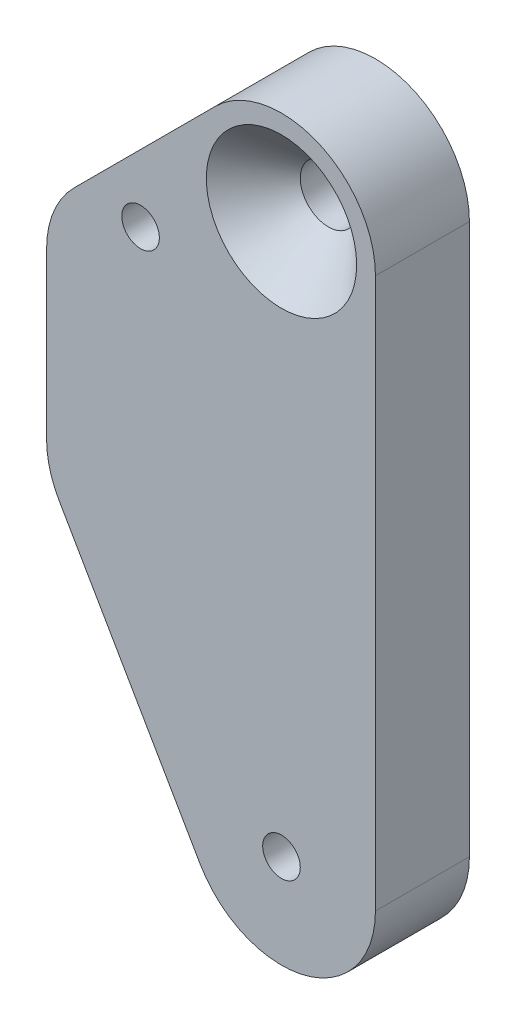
ISO-10303-21;
HEADER;
FILE_DESCRIPTION(('STEP AP214'),'2;1');
FILE_NAME('part.step','',(''),(''),'','','');
FILE_SCHEMA(('AUTOMOTIVE_DESIGN { 1 0 10303 214 1 1 1 1 }'));
ENDSEC;
DATA;
#1=APPLICATION_CONTEXT('core data for automotive mechanical design processes');
#2=APPLICATION_PROTOCOL_DEFINITION('international standard','automotive_design',2000,#1);
#3=PRODUCT_CONTEXT('',#1,'mechanical');
#4=PRODUCT('Part','Part','',(#3));
#5=PRODUCT_RELATED_PRODUCT_CATEGORY('part','',(#4));
#6=PRODUCT_DEFINITION_FORMATION('','',#4);
#7=PRODUCT_DEFINITION_CONTEXT('part definition',#1,'design');
#8=PRODUCT_DEFINITION('design','',#6,#7);
#9=PRODUCT_DEFINITION_SHAPE('','',#8);
#10=(LENGTH_UNIT() NAMED_UNIT(*) SI_UNIT(.MILLI.,.METRE.));
#11=(NAMED_UNIT(*) PLANE_ANGLE_UNIT() SI_UNIT($,.RADIAN.));
#12=(NAMED_UNIT(*) SI_UNIT($,.STERADIAN.) SOLID_ANGLE_UNIT());
#13=UNCERTAINTY_MEASURE_WITH_UNIT(LENGTH_MEASURE(1.E-05),#10,'distance_accuracy_value','');
#14=(GEOMETRIC_REPRESENTATION_CONTEXT(3) GLOBAL_UNCERTAINTY_ASSIGNED_CONTEXT((#13)) GLOBAL_UNIT_ASSIGNED_CONTEXT((#10,
#11,#12)) REPRESENTATION_CONTEXT('',''));
#15=CARTESIAN_POINT('',(0.,0.,0.));
#16=DIRECTION('',(0.,0.,1.));
#17=DIRECTION('',(1.,0.,0.));
#18=AXIS2_PLACEMENT_3D('',#15,#16,#17);
#19=CARTESIAN_POINT('',(-25.,115.,10.));
#20=DIRECTION('',(0.,0.,1.));
#21=DIRECTION('',(1.,0.,0.));
#22=AXIS2_PLACEMENT_3D('',#19,#20,#21);
#23=PLANE('',#22);
#24=CARTESIAN_POINT('',(-25.,115.,10.));
#25=DIRECTION('',(0.,0.,1.));
#26=DIRECTION('',(1.,0.,0.));
#27=AXIS2_PLACEMENT_3D('',#24,#25,#26);
#28=CIRCLE('',#27,8.00000000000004);
#29=CARTESIAN_POINT('',(-17.,115.,10.));
#30=VERTEX_POINT('',#29);
#31=EDGE_CURVE('E11',#30,#30,#28,.F.);
#32=ORIENTED_EDGE('',*,*,#31,.T.);
#33=EDGE_LOOP('',(#32));
#34=FACE_BOUND('',#33,.T.);
#35=CARTESIAN_POINT('',(-40.,107.,10.));
#36=DIRECTION('',(0.,0.,1.));
#37=DIRECTION('',(1.,0.,0.));
#38=AXIS2_PLACEMENT_3D('',#35,#36,#37);
#39=CIRCLE('',#38,2.);
#40=CARTESIAN_POINT('',(-38.,107.,10.));
#41=VERTEX_POINT('',#40);
#42=EDGE_CURVE('E248',#41,#41,#39,.T.);
#43=ORIENTED_EDGE('',*,*,#42,.F.);
#44=EDGE_LOOP('',(#43));
#45=FACE_BOUND('',#44,.T.);
#46=CARTESIAN_POINT('',(-25.,115.,10.));
#47=DIRECTION('',(0.,0.,1.));
#48=DIRECTION('',(1.,0.,0.));
#49=AXIS2_PLACEMENT_3D('',#46,#47,#48);
#50=CIRCLE('',#49,10.);
#51=CARTESIAN_POINT('',(-15.,115.,10.));
#52=VERTEX_POINT('',#51);
#53=CARTESIAN_POINT('',(-32.0710678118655,122.071067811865,10.));
#54=VERTEX_POINT('',#53);
#55=EDGE_CURVE('E156',#52,#54,#50,.T.);
#56=ORIENTED_EDGE('',*,*,#55,.T.);
#57=DIRECTION('',(-0.707106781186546,-0.707106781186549,0.));
#58=VECTOR('',#57,1.);
#59=CARTESIAN_POINT('',(-47.0710678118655,107.071067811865,10.));
#60=LINE('',#59,#58);
#61=CARTESIAN_POINT('',(-47.0710678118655,107.071067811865,10.));
#62=VERTEX_POINT('',#61);
#63=EDGE_CURVE('E98',#54,#62,#60,.T.);
#64=ORIENTED_EDGE('',*,*,#63,.T.);
#65=CARTESIAN_POINT('',(-40.,99.9999999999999,10.));
#66=DIRECTION('',(0.,0.,1.));
#67=DIRECTION('',(1.,0.,0.));
#68=AXIS2_PLACEMENT_3D('',#65,#66,#67);
#69=CIRCLE('',#68,10.);
#70=CARTESIAN_POINT('',(-50.,99.9999999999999,10.));
#71=VERTEX_POINT('',#70);
#72=EDGE_CURVE('E238',#62,#71,#69,.T.);
#73=ORIENTED_EDGE('',*,*,#72,.T.);
#74=DIRECTION('',(0.,-1.,0.));
#75=VECTOR('',#74,1.);
#76=CARTESIAN_POINT('',(-50.,99.9999999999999,10.));
#77=LINE('',#76,#75);
#78=CARTESIAN_POINT('',(-50.,82.4372013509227,10.));
#79=VERTEX_POINT('',#78);
#80=EDGE_CURVE('E240',#71,#79,#77,.T.);
#81=ORIENTED_EDGE('',*,*,#80,.T.);
#82=CARTESIAN_POINT('',(-40.,82.4372013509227,10.));
#83=DIRECTION('',(0.,0.,1.));
#84=DIRECTION('',(1.,0.,0.));
#85=AXIS2_PLACEMENT_3D('',#82,#83,#84);
#86=CIRCLE('',#85,10.);
#87=CARTESIAN_POINT('',(-48.6602540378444,77.4372013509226,10.));
#88=VERTEX_POINT('',#87);
#89=EDGE_CURVE('E119',#79,#88,#86,.T.);
#90=ORIENTED_EDGE('',*,*,#89,.T.);
#91=DIRECTION('',(0.500000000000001,-0.866025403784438,0.));
#92=VECTOR('',#91,1.);
#93=CARTESIAN_POINT('',(-48.6602540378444,77.4372013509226,10.));
#94=LINE('',#93,#92);
#95=CARTESIAN_POINT('',(-33.6602540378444,51.4564392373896,10.));
#96=VERTEX_POINT('',#95);
#97=EDGE_CURVE('E112',#88,#96,#94,.T.);
#98=ORIENTED_EDGE('',*,*,#97,.T.);
#99=CARTESIAN_POINT('',(-25.,56.4564392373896,10.));
#100=DIRECTION('',(0.,0.,1.));
#101=DIRECTION('',(1.,0.,0.));
#102=AXIS2_PLACEMENT_3D('',#99,#100,#101);
#103=CIRCLE('',#102,10.);
#104=CARTESIAN_POINT('',(-15.,56.4564392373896,10.));
#105=VERTEX_POINT('',#104);
#106=EDGE_CURVE('E116',#96,#105,#103,.T.);
#107=ORIENTED_EDGE('',*,*,#106,.T.);
#108=DIRECTION('',(0.,1.,0.));
#109=VECTOR('',#108,1.);
#110=CARTESIAN_POINT('',(-15.,115.,10.));
#111=LINE('',#110,#109);
#112=EDGE_CURVE('E56',#105,#52,#111,.T.);
#113=ORIENTED_EDGE('',*,*,#112,.T.);
#114=EDGE_LOOP('',(#56,#64,#73,#81,#90,#98,#107,#113));
#115=FACE_BOUND('',#114,.T.);
#116=CARTESIAN_POINT('',(-25.,56.4564392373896,10.));
#117=DIRECTION('',(0.,0.,1.));
#118=DIRECTION('',(1.,0.,0.));
#119=AXIS2_PLACEMENT_3D('',#116,#117,#118);
#120=CIRCLE('',#119,2.);
#121=CARTESIAN_POINT('',(-23.,56.4564392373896,10.));
#122=VERTEX_POINT('',#121);
#123=EDGE_CURVE('E252',#122,#122,#120,.T.);
#124=ORIENTED_EDGE('',*,*,#123,.F.);
#125=EDGE_LOOP('',(#124));
#126=FACE_BOUND('',#125,.T.);
#127=ADVANCED_FACE('F33',(#34,#45,#115,#126),#23,.T.);
#128=CARTESIAN_POINT('',(-25.,115.,0.));
#129=DIRECTION('',(0.,0.,1.));
#130=DIRECTION('',(1.,0.,0.));
#131=AXIS2_PLACEMENT_3D('',#128,#129,#130);
#132=PLANE('',#131);
#133=CARTESIAN_POINT('',(-40.,107.,0.));
#134=DIRECTION('',(0.,0.,1.));
#135=DIRECTION('',(1.,0.,0.));
#136=AXIS2_PLACEMENT_3D('',#133,#134,#135);
#137=CIRCLE('',#136,2.);
#138=CARTESIAN_POINT('',(-38.,107.,0.));
#139=VERTEX_POINT('',#138);
#140=EDGE_CURVE('E249',#139,#139,#137,.T.);
#141=ORIENTED_EDGE('',*,*,#140,.T.);
#142=EDGE_LOOP('',(#141));
#143=FACE_BOUND('',#142,.T.);
#144=CARTESIAN_POINT('',(-25.,115.,0.));
#145=DIRECTION('',(0.,0.,1.));
#146=DIRECTION('',(1.,0.,0.));
#147=AXIS2_PLACEMENT_3D('',#144,#145,#146);
#148=CIRCLE('',#147,10.);
#149=CARTESIAN_POINT('',(-15.,115.,0.));
#150=VERTEX_POINT('',#149);
#151=CARTESIAN_POINT('',(-32.0710678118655,122.071067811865,0.));
#152=VERTEX_POINT('',#151);
#153=EDGE_CURVE('E140',#150,#152,#148,.T.);
#154=ORIENTED_EDGE('',*,*,#153,.F.);
#155=DIRECTION('',(0.,1.,0.));
#156=VECTOR('',#155,1.);
#157=CARTESIAN_POINT('',(-15.,115.,0.));
#158=LINE('',#157,#156);
#159=CARTESIAN_POINT('',(-15.,56.4564392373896,0.));
#160=VERTEX_POINT('',#159);
#161=EDGE_CURVE('E89',#160,#150,#158,.T.);
#162=ORIENTED_EDGE('',*,*,#161,.F.);
#163=CARTESIAN_POINT('',(-25.,56.4564392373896,0.));
#164=DIRECTION('',(0.,0.,1.));
#165=DIRECTION('',(1.,0.,0.));
#166=AXIS2_PLACEMENT_3D('',#163,#164,#165);
#167=CIRCLE('',#166,10.);
#168=CARTESIAN_POINT('',(-33.6602540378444,51.4564392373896,0.));
#169=VERTEX_POINT('',#168);
#170=EDGE_CURVE('E153',#169,#160,#167,.T.);
#171=ORIENTED_EDGE('',*,*,#170,.F.);
#172=DIRECTION('',(0.500000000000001,-0.866025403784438,0.));
#173=VECTOR('',#172,1.);
#174=CARTESIAN_POINT('',(-48.6602540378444,77.4372013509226,0.));
#175=LINE('',#174,#173);
#176=CARTESIAN_POINT('',(-48.6602540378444,77.4372013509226,0.));
#177=VERTEX_POINT('',#176);
#178=EDGE_CURVE('E128',#177,#169,#175,.T.);
#179=ORIENTED_EDGE('',*,*,#178,.F.);
#180=CARTESIAN_POINT('',(-40.,82.4372013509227,0.));
#181=DIRECTION('',(0.,0.,1.));
#182=DIRECTION('',(1.,0.,0.));
#183=AXIS2_PLACEMENT_3D('',#180,#181,#182);
#184=CIRCLE('',#183,10.);
#185=CARTESIAN_POINT('',(-50.,82.4372013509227,0.));
#186=VERTEX_POINT('',#185);
#187=EDGE_CURVE('E150',#186,#177,#184,.T.);
#188=ORIENTED_EDGE('',*,*,#187,.F.);
#189=DIRECTION('',(0.,-1.,0.));
#190=VECTOR('',#189,1.);
#191=CARTESIAN_POINT('',(-50.,99.9999999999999,0.));
#192=LINE('',#191,#190);
#193=CARTESIAN_POINT('',(-50.,99.9999999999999,0.));
#194=VERTEX_POINT('',#193);
#195=EDGE_CURVE('E148',#194,#186,#192,.T.);
#196=ORIENTED_EDGE('',*,*,#195,.F.);
#197=CARTESIAN_POINT('',(-40.,99.9999999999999,0.));
#198=DIRECTION('',(0.,0.,1.));
#199=DIRECTION('',(1.,0.,0.));
#200=AXIS2_PLACEMENT_3D('',#197,#198,#199);
#201=CIRCLE('',#200,10.);
#202=CARTESIAN_POINT('',(-47.0710678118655,107.071067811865,0.));
#203=VERTEX_POINT('',#202);
#204=EDGE_CURVE('E146',#203,#194,#201,.T.);
#205=ORIENTED_EDGE('',*,*,#204,.F.);
#206=DIRECTION('',(-0.707106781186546,-0.707106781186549,0.));
#207=VECTOR('',#206,1.);
#208=CARTESIAN_POINT('',(-47.0710678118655,107.071067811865,0.));
#209=LINE('',#208,#207);
#210=EDGE_CURVE('E143',#152,#203,#209,.T.);
#211=ORIENTED_EDGE('',*,*,#210,.F.);
#212=EDGE_LOOP('',(#154,#162,#171,#179,#188,#196,#205,#211));
#213=FACE_BOUND('',#212,.T.);
#214=CARTESIAN_POINT('',(-25.,115.,0.));
#215=DIRECTION('',(0.,0.,1.));
#216=DIRECTION('',(1.,0.,0.));
#217=AXIS2_PLACEMENT_3D('',#214,#215,#216);
#218=CIRCLE('',#217,3.);
#219=CARTESIAN_POINT('',(-22.,115.,0.));
#220=VERTEX_POINT('',#219);
#221=EDGE_CURVE('E144',#220,#220,#218,.T.);
#222=ORIENTED_EDGE('',*,*,#221,.T.);
#223=EDGE_LOOP('',(#222));
#224=FACE_BOUND('',#223,.T.);
#225=CARTESIAN_POINT('',(-25.,56.4564392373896,0.));
#226=DIRECTION('',(0.,0.,1.));
#227=DIRECTION('',(1.,0.,0.));
#228=AXIS2_PLACEMENT_3D('',#225,#226,#227);
#229=CIRCLE('',#228,2.);
#230=CARTESIAN_POINT('',(-23.,56.4564392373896,0.));
#231=VERTEX_POINT('',#230);
#232=EDGE_CURVE('E255',#231,#231,#229,.T.);
#233=ORIENTED_EDGE('',*,*,#232,.T.);
#234=EDGE_LOOP('',(#233));
#235=FACE_BOUND('',#234,.T.);
#236=ADVANCED_FACE('F190',(#143,#213,#224,#235),#132,.F.);
#237=CARTESIAN_POINT('',(-25.,115.,10.));
#238=DIRECTION('',(0.,0.,-1.));
#239=DIRECTION('',(-1.,0.,0.));
#240=AXIS2_PLACEMENT_3D('',#237,#238,#239);
#241=CYLINDRICAL_SURFACE('',#240,10.);
#242=ORIENTED_EDGE('',*,*,#153,.T.);
#243=DIRECTION('',(0.,0.,-1.));
#244=VECTOR('',#243,1.);
#245=CARTESIAN_POINT('',(-32.0710678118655,122.071067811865,10.));
#246=LINE('',#245,#244);
#247=EDGE_CURVE('E169',#54,#152,#246,.T.);
#248=ORIENTED_EDGE('',*,*,#247,.F.);
#249=ORIENTED_EDGE('',*,*,#55,.F.);
#250=DIRECTION('',(0.,0.,-1.));
#251=VECTOR('',#250,1.);
#252=CARTESIAN_POINT('',(-15.,115.,10.));
#253=LINE('',#252,#251);
#254=EDGE_CURVE('E136',#52,#150,#253,.T.);
#255=ORIENTED_EDGE('',*,*,#254,.T.);
#256=EDGE_LOOP('',(#242,#248,#249,#255));
#257=FACE_BOUND('',#256,.T.);
#258=ADVANCED_FACE('F196',(#257),#241,.T.);
#259=CARTESIAN_POINT('',(-47.0710678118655,107.071067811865,10.));
#260=DIRECTION('',(0.707106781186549,-0.707106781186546,0.));
#261=DIRECTION('',(0.707106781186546,0.707106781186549,0.));
#262=AXIS2_PLACEMENT_3D('',#259,#260,#261);
#263=PLANE('',#262);
#264=CARTESIAN_POINT('',(-43.5710678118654,110.571067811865,5.));
#265=DIRECTION('',(-0.707106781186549,0.707106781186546,0.));
#266=DIRECTION('',(-0.707106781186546,-0.707106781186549,0.));
#267=AXIS2_PLACEMENT_3D('',#264,#265,#266);
#268=CIRCLE('',#267,2.);
#269=CARTESIAN_POINT('',(-44.9852813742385,109.156854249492,5.));
#270=VERTEX_POINT('',#269);
#271=EDGE_CURVE('E258',#270,#270,#268,.T.);
#272=ORIENTED_EDGE('',*,*,#271,.F.);
#273=EDGE_LOOP('',(#272));
#274=FACE_BOUND('',#273,.T.);
#275=ORIENTED_EDGE('',*,*,#210,.T.);
#276=DIRECTION('',(0.,0.,-1.));
#277=VECTOR('',#276,1.);
#278=CARTESIAN_POINT('',(-47.0710678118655,107.071067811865,10.));
#279=LINE('',#278,#277);
#280=EDGE_CURVE('E166',#62,#203,#279,.T.);
#281=ORIENTED_EDGE('',*,*,#280,.F.);
#282=ORIENTED_EDGE('',*,*,#63,.F.);
#283=ORIENTED_EDGE('',*,*,#247,.T.);
#284=EDGE_LOOP('',(#275,#281,#282,#283));
#285=FACE_BOUND('',#284,.T.);
#286=ADVANCED_FACE('F221',(#274,#285),#263,.F.);
#287=CARTESIAN_POINT('',(-40.,99.9999999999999,10.));
#288=DIRECTION('',(0.,0.,-1.));
#289=DIRECTION('',(-1.,0.,0.));
#290=AXIS2_PLACEMENT_3D('',#287,#288,#289);
#291=CYLINDRICAL_SURFACE('',#290,10.);
#292=ORIENTED_EDGE('',*,*,#204,.T.);
#293=DIRECTION('',(0.,0.,-1.));
#294=VECTOR('',#293,1.);
#295=CARTESIAN_POINT('',(-50.,99.9999999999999,10.));
#296=LINE('',#295,#294);
#297=EDGE_CURVE('E163',#71,#194,#296,.T.);
#298=ORIENTED_EDGE('',*,*,#297,.F.);
#299=ORIENTED_EDGE('',*,*,#72,.F.);
#300=ORIENTED_EDGE('',*,*,#280,.T.);
#301=EDGE_LOOP('',(#292,#298,#299,#300));
#302=FACE_BOUND('',#301,.T.);
#303=ADVANCED_FACE('F217',(#302),#291,.T.);
#304=CARTESIAN_POINT('',(-50.,99.9999999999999,10.));
#305=DIRECTION('',(1.,0.,0.));
#306=DIRECTION('',(0.,0.,-1.));
#307=AXIS2_PLACEMENT_3D('',#304,#305,#306);
#308=PLANE('',#307);
#309=ORIENTED_EDGE('',*,*,#195,.T.);
#310=DIRECTION('',(0.,0.,-1.));
#311=VECTOR('',#310,1.);
#312=CARTESIAN_POINT('',(-50.,82.4372013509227,10.));
#313=LINE('',#312,#311);
#314=EDGE_CURVE('E160',#79,#186,#313,.T.);
#315=ORIENTED_EDGE('',*,*,#314,.F.);
#316=ORIENTED_EDGE('',*,*,#80,.F.);
#317=ORIENTED_EDGE('',*,*,#297,.T.);
#318=EDGE_LOOP('',(#309,#315,#316,#317));
#319=FACE_BOUND('',#318,.T.);
#320=ADVANCED_FACE('F213',(#319),#308,.F.);
#321=CARTESIAN_POINT('',(-40.,82.4372013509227,10.));
#322=DIRECTION('',(0.,0.,-1.));
#323=DIRECTION('',(-1.,0.,0.));
#324=AXIS2_PLACEMENT_3D('',#321,#322,#323);
#325=CYLINDRICAL_SURFACE('',#324,10.);
#326=ORIENTED_EDGE('',*,*,#187,.T.);
#327=DIRECTION('',(0.,0.,-1.));
#328=VECTOR('',#327,1.);
#329=CARTESIAN_POINT('',(-48.6602540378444,77.4372013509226,10.));
#330=LINE('',#329,#328);
#331=EDGE_CURVE('E131',#88,#177,#330,.T.);
#332=ORIENTED_EDGE('',*,*,#331,.F.);
#333=ORIENTED_EDGE('',*,*,#89,.F.);
#334=ORIENTED_EDGE('',*,*,#314,.T.);
#335=EDGE_LOOP('',(#326,#332,#333,#334));
#336=FACE_BOUND('',#335,.T.);
#337=ADVANCED_FACE('F210',(#336),#325,.T.);
#338=CARTESIAN_POINT('',(-48.6602540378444,77.4372013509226,10.));
#339=DIRECTION('',(0.866025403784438,0.500000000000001,0.));
#340=DIRECTION('',(-0.500000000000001,0.866025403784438,0.));
#341=AXIS2_PLACEMENT_3D('',#338,#339,#340);
#342=PLANE('',#341);
#343=ORIENTED_EDGE('',*,*,#178,.T.);
#344=DIRECTION('',(0.,0.,-1.));
#345=VECTOR('',#344,1.);
#346=CARTESIAN_POINT('',(-33.6602540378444,51.4564392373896,10.));
#347=LINE('',#346,#345);
#348=EDGE_CURVE('E125',#96,#169,#347,.T.);
#349=ORIENTED_EDGE('',*,*,#348,.F.);
#350=ORIENTED_EDGE('',*,*,#97,.F.);
#351=ORIENTED_EDGE('',*,*,#331,.T.);
#352=EDGE_LOOP('',(#343,#349,#350,#351));
#353=FACE_BOUND('',#352,.T.);
#354=ADVANCED_FACE('F126',(#353),#342,.F.);
#355=CARTESIAN_POINT('',(-25.,56.4564392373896,10.));
#356=DIRECTION('',(0.,0.,-1.));
#357=DIRECTION('',(-1.,0.,0.));
#358=AXIS2_PLACEMENT_3D('',#355,#356,#357);
#359=CYLINDRICAL_SURFACE('',#358,10.);
#360=ORIENTED_EDGE('',*,*,#170,.T.);
#361=DIRECTION('',(0.,0.,-1.));
#362=VECTOR('',#361,1.);
#363=CARTESIAN_POINT('',(-15.,56.4564392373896,10.));
#364=LINE('',#363,#362);
#365=EDGE_CURVE('E132',#105,#160,#364,.T.);
#366=ORIENTED_EDGE('',*,*,#365,.F.);
#367=ORIENTED_EDGE('',*,*,#106,.F.);
#368=ORIENTED_EDGE('',*,*,#348,.T.);
#369=EDGE_LOOP('',(#360,#366,#367,#368));
#370=FACE_BOUND('',#369,.T.);
#371=ADVANCED_FACE('F134',(#370),#359,.T.);
#372=CARTESIAN_POINT('',(-15.,115.,10.));
#373=DIRECTION('',(-1.,0.,0.));
#374=DIRECTION('',(0.,0.,1.));
#375=AXIS2_PLACEMENT_3D('',#372,#373,#374);
#376=PLANE('',#375);
#377=ORIENTED_EDGE('',*,*,#161,.T.);
#378=ORIENTED_EDGE('',*,*,#254,.F.);
#379=ORIENTED_EDGE('',*,*,#112,.F.);
#380=ORIENTED_EDGE('',*,*,#365,.T.);
#381=EDGE_LOOP('',(#377,#378,#379,#380));
#382=FACE_BOUND('',#381,.T.);
#383=ADVANCED_FACE('F203',(#382),#376,.F.);
#384=CARTESIAN_POINT('',(-25.,115.,10.));
#385=DIRECTION('',(0.,0.,-1.));
#386=DIRECTION('',(-1.,0.,0.));
#387=AXIS2_PLACEMENT_3D('',#384,#385,#386);
#388=CYLINDRICAL_SURFACE('',#387,3.);
#389=CARTESIAN_POINT('',(-25.,115.,4.99999999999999));
#390=DIRECTION('',(0.,0.,1.));
#391=DIRECTION('',(1.,0.,0.));
#392=AXIS2_PLACEMENT_3D('',#389,#390,#391);
#393=CIRCLE('',#392,3.);
#394=CARTESIAN_POINT('',(-22.,115.,4.99999999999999));
#395=VERTEX_POINT('',#394);
#396=EDGE_CURVE('E41',#395,#395,#393,.T.);
#397=ORIENTED_EDGE('',*,*,#396,.T.);
#398=EDGE_LOOP('',(#397));
#399=FACE_BOUND('',#398,.T.);
#400=ORIENTED_EDGE('',*,*,#221,.F.);
#401=EDGE_LOOP('',(#400));
#402=FACE_BOUND('',#401,.T.);
#403=ADVANCED_FACE('F173',(#399,#402),#388,.F.);
#404=CARTESIAN_POINT('',(-40.,107.,10.));
#405=DIRECTION('',(0.,0.,-1.));
#406=DIRECTION('',(-1.,0.,0.));
#407=AXIS2_PLACEMENT_3D('',#404,#405,#406);
#408=CYLINDRICAL_SURFACE('',#407,2.);
#409=CARTESIAN_POINT('',(-40.,107.,5.));
#410=DIRECTION('',(-0.500000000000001,0.499999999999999,-0.707106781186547));
#411=DIRECTION('',(-0.500000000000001,0.499999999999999,0.707106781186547));
#412=AXIS2_PLACEMENT_3D('',#409,#410,#411);
#413=ELLIPSE('',#412,2.82842712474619,2.);
#414=CARTESIAN_POINT('',(-41.4142135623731,105.585786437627,5.));
#415=VERTEX_POINT('',#414);
#416=CARTESIAN_POINT('',(-38.5857864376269,108.414213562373,5.));
#417=VERTEX_POINT('',#416);
#418=EDGE_CURVE('E47',#415,#417,#413,.T.);
#419=ORIENTED_EDGE('',*,*,#418,.T.);
#420=CARTESIAN_POINT('',(-40.,107.,5.));
#421=DIRECTION('',(-0.500000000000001,0.499999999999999,0.707106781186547));
#422=DIRECTION('',(-0.500000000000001,0.499999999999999,-0.707106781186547));
#423=AXIS2_PLACEMENT_3D('',#420,#421,#422);
#424=ELLIPSE('',#423,2.82842712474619,2.);
#425=EDGE_CURVE('E263',#417,#415,#424,.T.);
#426=ORIENTED_EDGE('',*,*,#425,.T.);
#427=EDGE_LOOP('',(#419,#426));
#428=FACE_BOUND('',#427,.T.);
#429=ORIENTED_EDGE('',*,*,#42,.T.);
#430=EDGE_LOOP('',(#429));
#431=FACE_BOUND('',#430,.T.);
#432=ORIENTED_EDGE('',*,*,#140,.F.);
#433=EDGE_LOOP('',(#432));
#434=FACE_BOUND('',#433,.T.);
#435=ADVANCED_FACE('F185',(#428,#431,#434),#408,.F.);
#436=CARTESIAN_POINT('',(-25.,56.4564392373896,10.));
#437=DIRECTION('',(0.,0.,-1.));
#438=DIRECTION('',(-1.,0.,0.));
#439=AXIS2_PLACEMENT_3D('',#436,#437,#438);
#440=CYLINDRICAL_SURFACE('',#439,2.);
#441=ORIENTED_EDGE('',*,*,#123,.T.);
#442=EDGE_LOOP('',(#441));
#443=FACE_BOUND('',#442,.T.);
#444=ORIENTED_EDGE('',*,*,#232,.F.);
#445=EDGE_LOOP('',(#444));
#446=FACE_BOUND('',#445,.T.);
#447=ADVANCED_FACE('F178',(#443,#446),#440,.F.);
#448=CARTESIAN_POINT('',(-25.,115.,4.99999999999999));
#449=DIRECTION('',(0.,0.,1.));
#450=DIRECTION('',(1.,0.,0.));
#451=AXIS2_PLACEMENT_3D('',#448,#449,#450);
#452=CONICAL_SURFACE('',#451,3.,0.785398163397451);
#453=CARTESIAN_POINT('',(-17.,115.,10.));
#454=CARTESIAN_POINT('',(-17.0520833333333,115.,9.94791666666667));
#455=CARTESIAN_POINT('',(-17.1041666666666,115.,9.89583333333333));
#456=CARTESIAN_POINT('',(-17.2083333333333,115.,9.79166666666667));
#457=CARTESIAN_POINT('',(-17.2604166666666,115.,9.73958333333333));
#458=CARTESIAN_POINT('',(-17.3645833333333,115.,9.63541666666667));
#459=CARTESIAN_POINT('',(-17.4166666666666,115.,9.58333333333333));
#460=CARTESIAN_POINT('',(-17.5208333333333,115.,9.47916666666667));
#461=CARTESIAN_POINT('',(-17.5729166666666,115.,9.42708333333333));
#462=CARTESIAN_POINT('',(-17.6770833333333,115.,9.32291666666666));
#463=CARTESIAN_POINT('',(-17.7291666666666,115.,9.27083333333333));
#464=CARTESIAN_POINT('',(-17.8333333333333,115.,9.16666666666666));
#465=CARTESIAN_POINT('',(-17.8854166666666,115.,9.11458333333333));
#466=CARTESIAN_POINT('',(-17.9895833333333,115.,9.01041666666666));
#467=CARTESIAN_POINT('',(-18.0416666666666,115.,8.95833333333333));
#468=CARTESIAN_POINT('',(-18.1458333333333,115.,8.85416666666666));
#469=CARTESIAN_POINT('',(-18.1979166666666,115.,8.80208333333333));
#470=CARTESIAN_POINT('',(-18.3020833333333,115.,8.69791666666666));
#471=CARTESIAN_POINT('',(-18.3541666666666,115.,8.64583333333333));
#472=CARTESIAN_POINT('',(-18.4583333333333,115.,8.54166666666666));
#473=CARTESIAN_POINT('',(-18.5104166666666,115.,8.48958333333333));
#474=CARTESIAN_POINT('',(-18.6145833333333,115.,8.38541666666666));
#475=CARTESIAN_POINT('',(-18.6666666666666,115.,8.33333333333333));
#476=CARTESIAN_POINT('',(-18.7708333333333,115.,8.22916666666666));
#477=CARTESIAN_POINT('',(-18.8229166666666,115.,8.17708333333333));
#478=CARTESIAN_POINT('',(-18.9270833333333,115.,8.07291666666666));
#479=CARTESIAN_POINT('',(-18.9791666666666,115.,8.02083333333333));
#480=CARTESIAN_POINT('',(-19.0833333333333,115.,7.91666666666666));
#481=CARTESIAN_POINT('',(-19.1354166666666,115.,7.86458333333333));
#482=CARTESIAN_POINT('',(-19.2395833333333,115.,7.76041666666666));
#483=CARTESIAN_POINT('',(-19.2916666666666,115.,7.70833333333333));
#484=CARTESIAN_POINT('',(-19.3958333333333,115.,7.60416666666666));
#485=CARTESIAN_POINT('',(-19.4479166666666,115.,7.55208333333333));
#486=CARTESIAN_POINT('',(-19.5520833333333,115.,7.44791666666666));
#487=CARTESIAN_POINT('',(-19.6041666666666,115.,7.39583333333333));
#488=CARTESIAN_POINT('',(-19.7083333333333,115.,7.29166666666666));
#489=CARTESIAN_POINT('',(-19.7604166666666,115.,7.23958333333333));
#490=CARTESIAN_POINT('',(-19.8645833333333,115.,7.13541666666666));
#491=CARTESIAN_POINT('',(-19.9166666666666,115.,7.08333333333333));
#492=CARTESIAN_POINT('',(-20.0208333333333,115.,6.97916666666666));
#493=CARTESIAN_POINT('',(-20.0729166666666,115.,6.92708333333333));
#494=CARTESIAN_POINT('',(-20.1770833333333,115.,6.82291666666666));
#495=CARTESIAN_POINT('',(-20.2291666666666,115.,6.77083333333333));
#496=CARTESIAN_POINT('',(-20.3333333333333,115.,6.66666666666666));
#497=CARTESIAN_POINT('',(-20.3854166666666,115.,6.61458333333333));
#498=CARTESIAN_POINT('',(-20.4895833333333,115.,6.51041666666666));
#499=CARTESIAN_POINT('',(-20.5416666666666,115.,6.45833333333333));
#500=CARTESIAN_POINT('',(-20.6458333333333,115.,6.35416666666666));
#501=CARTESIAN_POINT('',(-20.6979166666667,115.,6.30208333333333));
#502=CARTESIAN_POINT('',(-20.8020833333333,115.,6.19791666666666));
#503=CARTESIAN_POINT('',(-20.8541666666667,115.,6.14583333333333));
#504=CARTESIAN_POINT('',(-20.9583333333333,115.,6.04166666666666));
#505=CARTESIAN_POINT('',(-21.0104166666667,115.,5.98958333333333));
#506=CARTESIAN_POINT('',(-21.1145833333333,115.,5.88541666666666));
#507=CARTESIAN_POINT('',(-21.1666666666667,115.,5.83333333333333));
#508=CARTESIAN_POINT('',(-21.2708333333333,115.,5.72916666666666));
#509=CARTESIAN_POINT('',(-21.3229166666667,115.,5.67708333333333));
#510=CARTESIAN_POINT('',(-21.4270833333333,115.,5.57291666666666));
#511=CARTESIAN_POINT('',(-21.4791666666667,115.,5.52083333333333));
#512=CARTESIAN_POINT('',(-21.5833333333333,115.,5.41666666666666));
#513=CARTESIAN_POINT('',(-21.6354166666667,115.,5.36458333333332));
#514=CARTESIAN_POINT('',(-21.7395833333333,115.,5.26041666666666));
#515=CARTESIAN_POINT('',(-21.7916666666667,115.,5.20833333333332));
#516=CARTESIAN_POINT('',(-21.8958333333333,115.,5.10416666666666));
#517=CARTESIAN_POINT('',(-21.9479166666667,115.,5.05208333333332));
#518=CARTESIAN_POINT('',(-22.,115.,4.99999999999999));
#519=B_SPLINE_CURVE_WITH_KNOTS('',3,(#453,#454,#455,#456,#457,#458,#459,#460,#461,#462,#463,
#464,#465,#466,#467,#468,#469,#470,#471,#472,#473,#474,#475,#476,#477,#478,#479,#480,#481,#482,
#483,#484,#485,#486,#487,#488,#489,#490,#491,#492,#493,#494,#495,#496,#497,#498,#499,#500,#501,
#502,#503,#504,#505,#506,#507,#508,#509,#510,#511,#512,#513,#514,#515,#516,#517,#518),
.UNSPECIFIED.,.F.,.F.,(4,2,2,2,2,2,2,2,2,2,2,2,2,2,2,2,2,2,2,2,2,2,2,2,2,2,2,2,2,2,2,2,4),(0.,
0.220970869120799,0.441941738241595,0.662912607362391,0.88388347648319,1.10485434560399,
1.32582521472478,1.54679608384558,1.76776695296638,1.98873782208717,2.20970869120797,
2.43067956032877,2.65165042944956,2.87262129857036,3.09359216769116,3.31456303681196,
3.53553390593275,3.75650477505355,3.97747564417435,4.19844651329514,4.41941738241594,
4.64038825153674,4.86135912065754,5.08232998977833,5.30330085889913,5.52427172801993,
5.74524259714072,5.96621346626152,6.18718433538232,6.40815520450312,6.62912607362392,
6.85009694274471,7.07106781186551),.UNSPECIFIED.);
#520=EDGE_CURVE('BSEAM35',#30,#395,#519,.T.);
#521=ORIENTED_EDGE('',*,*,#31,.F.);
#522=ORIENTED_EDGE('',*,*,#396,.F.);
#523=ORIENTED_EDGE('',*,*,#520,.T.);
#524=ORIENTED_EDGE('',*,*,#520,.F.);
#525=EDGE_LOOP('',(#521,#523,#522,#524));
#526=FACE_BOUND('',#525,.T.);
#527=ADVANCED_FACE('F35',(#526),#452,.F.);
#528=CARTESIAN_POINT('',(2.77278038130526,64.2272196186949,5.));
#529=DIRECTION('',(-0.707106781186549,0.707106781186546,0.));
#530=DIRECTION('',(-0.707106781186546,-0.707106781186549,0.));
#531=AXIS2_PLACEMENT_3D('',#528,#529,#530);
#532=CYLINDRICAL_SURFACE('',#531,2.);
#533=ORIENTED_EDGE('',*,*,#425,.F.);
#534=ORIENTED_EDGE('',*,*,#418,.F.);
#535=EDGE_LOOP('',(#533,#534));
#536=FACE_BOUND('',#535,.T.);
#537=ORIENTED_EDGE('',*,*,#271,.T.);
#538=EDGE_LOOP('',(#537));
#539=FACE_BOUND('',#538,.T.);
#540=ADVANCED_FACE('F177',(#536,#539),#532,.F.);
#541=CLOSED_SHELL('',(#127,#236,#258,#286,#303,#320,#337,#354,#371,#383,#403,#435,#447,#527,#540));
#542=MANIFOLD_SOLID_BREP('B2',#541);
#543=ADVANCED_BREP_SHAPE_REPRESENTATION('',(#18,#542),#14);
#544=SHAPE_DEFINITION_REPRESENTATION(#9,#543);
ENDSEC;
END-ISO-10303-21;
